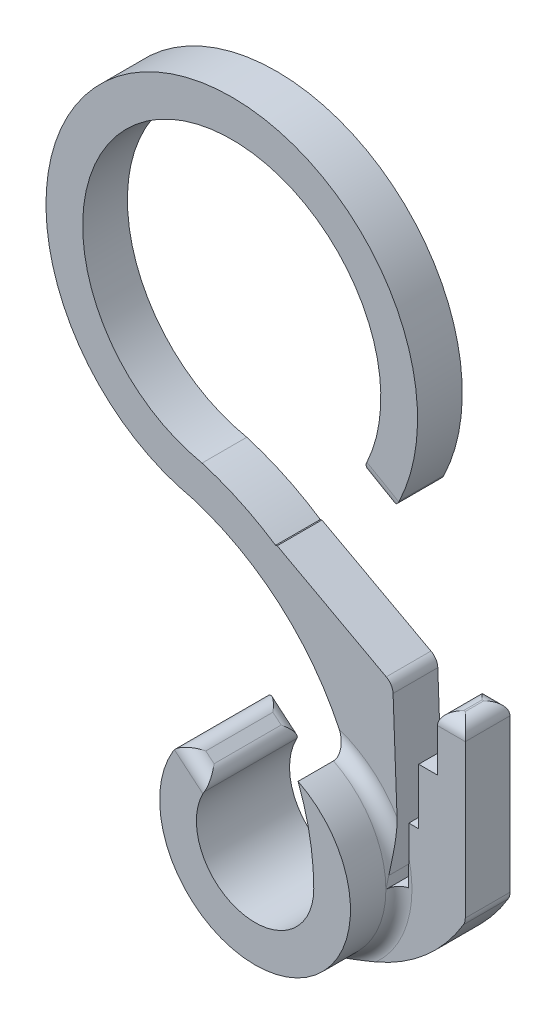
ISO-10303-21;
HEADER;
FILE_DESCRIPTION(('STEP AP214'),'2;1');
FILE_NAME('part.step','',(''),(''),'','','');
FILE_SCHEMA(('AUTOMOTIVE_DESIGN { 1 0 10303 214 1 1 1 1 }'));
ENDSEC;
DATA;
#1=APPLICATION_CONTEXT('core data for automotive mechanical design processes');
#2=APPLICATION_PROTOCOL_DEFINITION('international standard','automotive_design',2000,#1);
#3=PRODUCT_CONTEXT('',#1,'mechanical');
#4=PRODUCT('Part','Part','',(#3));
#5=PRODUCT_RELATED_PRODUCT_CATEGORY('part','',(#4));
#6=PRODUCT_DEFINITION_FORMATION('','',#4);
#7=PRODUCT_DEFINITION_CONTEXT('part definition',#1,'design');
#8=PRODUCT_DEFINITION('design','',#6,#7);
#9=PRODUCT_DEFINITION_SHAPE('','',#8);
#10=(LENGTH_UNIT() NAMED_UNIT(*) SI_UNIT(.MILLI.,.METRE.));
#11=(NAMED_UNIT(*) PLANE_ANGLE_UNIT() SI_UNIT($,.RADIAN.));
#12=(NAMED_UNIT(*) SI_UNIT($,.STERADIAN.) SOLID_ANGLE_UNIT());
#13=UNCERTAINTY_MEASURE_WITH_UNIT(LENGTH_MEASURE(1.E-05),#10,'distance_accuracy_value','');
#14=(GEOMETRIC_REPRESENTATION_CONTEXT(3) GLOBAL_UNCERTAINTY_ASSIGNED_CONTEXT((#13)) GLOBAL_UNIT_ASSIGNED_CONTEXT((#10,
#11,#12)) REPRESENTATION_CONTEXT('',''));
#15=CARTESIAN_POINT('',(0.,0.,0.));
#16=DIRECTION('',(0.,0.,1.));
#17=DIRECTION('',(1.,0.,0.));
#18=AXIS2_PLACEMENT_3D('',#15,#16,#17);
#19=CARTESIAN_POINT('',(0.,0.,3.1));
#20=DIRECTION('',(0.,0.,1.));
#21=DIRECTION('',(1.,0.,0.));
#22=AXIS2_PLACEMENT_3D('',#19,#20,#21);
#23=TOROIDAL_SURFACE('',#22,5.82,0.7);
#24=CARTESIAN_POINT('',(5.82,0.,3.1));
#25=DIRECTION('',(0.,1.,0.));
#26=DIRECTION('',(-1.,0.,0.));
#27=AXIS2_PLACEMENT_3D('',#24,#25,#26);
#28=CIRCLE('',#27,0.7);
#29=CARTESIAN_POINT('',(5.12,0.,3.09999793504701));
#30=VERTEX_POINT('',#29);
#31=CARTESIAN_POINT('',(5.65,0.,2.4209565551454));
#32=VERTEX_POINT('',#31);
#33=EDGE_CURVE('E107',#30,#32,#28,.F.);
#34=ORIENTED_EDGE('',*,*,#33,.F.);
#35=CARTESIAN_POINT('',(0.,0.,3.1));
#36=DIRECTION('',(0.,0.,1.));
#37=DIRECTION('',(1.,0.,0.));
#38=AXIS2_PLACEMENT_3D('',#35,#36,#37);
#39=CIRCLE('',#38,5.12);
#40=CARTESIAN_POINT('',(0.,-5.12,3.1));
#41=VERTEX_POINT('',#40);
#42=EDGE_CURVE('E514',#41,#30,#39,.T.);
#43=ORIENTED_EDGE('',*,*,#42,.F.);
#44=CARTESIAN_POINT('',(3.88248314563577,-4.3357496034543,2.4));
#45=CARTESIAN_POINT('',(3.77393906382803,-4.3814716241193,2.400042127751));
#46=CARTESIAN_POINT('',(3.66462624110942,-4.42524937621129,2.4031480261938));
#47=CARTESIAN_POINT('',(3.44484362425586,-4.508808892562,2.41462716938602));
#48=CARTESIAN_POINT('',(3.33437475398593,-4.54859361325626,2.42299648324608));
#49=CARTESIAN_POINT('',(3.11268098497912,-4.6240656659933,2.4441274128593));
#50=CARTESIAN_POINT('',(3.00145763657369,-4.6597596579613,2.45688175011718));
#51=CARTESIAN_POINT('',(2.77826335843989,-4.72711763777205,2.48614227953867));
#52=CARTESIAN_POINT('',(2.6662922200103,-4.75878044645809,2.50264956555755));
#53=CARTESIAN_POINT('',(2.34495078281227,-4.84364442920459,2.55444875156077));
#54=CARTESIAN_POINT('',(2.13487113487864,-4.89186779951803,2.59366236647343));
#55=CARTESIAN_POINT('',(1.71363145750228,-4.97445557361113,2.67993887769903));
#56=CARTESIAN_POINT('',(1.50247098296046,-5.00881370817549,2.72700531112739));
#57=CARTESIAN_POINT('',(0.868026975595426,-5.09138398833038,2.8758828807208));
#58=CARTESIAN_POINT('',(0.443595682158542,-5.11914035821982,2.98540697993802));
#59=CARTESIAN_POINT('',(0.0132213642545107,-5.1199934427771,3.09658450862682));
#60=CARTESIAN_POINT('',(0.00661059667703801,-5.11999999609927,3.09829228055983));
#61=CARTESIAN_POINT('',(0.,-5.12,3.1));
#62=B_SPLINE_CURVE_WITH_KNOTS('',3,(#44,#45,#46,#47,#48,#49,#50,#51,#52,#53,#54,#55,#56,#57,#58,
#59,#60,#61),.UNSPECIFIED.,.F.,.F.,(4,2,2,2,2,2,2,2,4),(0.,0.353218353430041,0.706173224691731,
1.05854504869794,1.41101970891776,2.06750890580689,2.72429460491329,4.03728688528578,
4.05777025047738),.UNSPECIFIED.);
#63=CARTESIAN_POINT('',(3.88248314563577,-4.3357496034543,2.4));
#64=VERTEX_POINT('',#63);
#65=EDGE_CURVE('E99',#64,#41,#62,.T.);
#66=ORIENTED_EDGE('',*,*,#65,.F.);
#67=CARTESIAN_POINT('',(0.,0.,2.4));
#68=DIRECTION('',(0.,0.,1.));
#69=DIRECTION('',(1.,0.,0.));
#70=AXIS2_PLACEMENT_3D('',#67,#68,#69);
#71=CIRCLE('',#70,5.82);
#72=CARTESIAN_POINT('',(5.65,1.39638819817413,2.4));
#73=VERTEX_POINT('',#72);
#74=EDGE_CURVE('E527',#73,#64,#71,.F.);
#75=ORIENTED_EDGE('',*,*,#74,.F.);
#76=CARTESIAN_POINT('',(5.65,0.,2.4209565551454));
#77=CARTESIAN_POINT('',(5.65,0.0581933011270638,2.42096290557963));
#78=CARTESIAN_POINT('',(5.65,0.116386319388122,2.42073077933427));
#79=CARTESIAN_POINT('',(5.65,0.232767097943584,2.41984357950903));
#80=CARTESIAN_POINT('',(5.65,0.290954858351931,2.41918852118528));
#81=CARTESIAN_POINT('',(5.65,0.465509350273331,2.41666992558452));
#82=CARTESIAN_POINT('',(5.65,0.58186745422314,2.41425296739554));
#83=CARTESIAN_POINT('',(5.65,0.814567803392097,2.40898907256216));
#84=CARTESIAN_POINT('',(5.65,0.930910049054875,2.40614215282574));
#85=CARTESIAN_POINT('',(5.65,1.10544473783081,2.40277443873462));
#86=CARTESIAN_POINT('',(5.65,1.16362709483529,2.40180230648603));
#87=CARTESIAN_POINT('',(5.65,1.28000140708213,2.40041717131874));
#88=CARTESIAN_POINT('',(5.65,1.33819336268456,2.4000042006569));
#89=CARTESIAN_POINT('',(5.65,1.39638819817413,2.4));
#90=B_SPLINE_CURVE_WITH_KNOTS('',3,(#76,#77,#78,#79,#80,#81,#82,#83,#84,#85,#86,#87,#88,#89),
.UNSPECIFIED.,.F.,.F.,(4,2,2,2,2,2,4),(0.,0.174579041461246,0.349151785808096,0.698296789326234,
1.04742806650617,1.22199714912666,1.3965763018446),.UNSPECIFIED.);
#91=EDGE_CURVE('E739',#32,#73,#90,.T.);
#92=ORIENTED_EDGE('',*,*,#91,.F.);
#93=EDGE_LOOP('',(#34,#43,#66,#75,#92));
#94=FACE_BOUND('',#93,.T.);
#95=ADVANCED_FACE('F89',(#94),#23,.F.);
#96=CARTESIAN_POINT('',(-9.68336484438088,0.,2.4));
#97=DIRECTION('',(0.,0.,-1.));
#98=DIRECTION('',(-1.,0.,0.));
#99=AXIS2_PLACEMENT_3D('',#96,#97,#98);
#100=CYLINDRICAL_SURFACE('',#99,14.8033648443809);
#101=DIRECTION('',(0.,0.,-1.));
#102=VECTOR('',#101,1.);
#103=CARTESIAN_POINT('',(5.10941087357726,0.559818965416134,2.4));
#104=LINE('',#103,#102);
#105=CARTESIAN_POINT('',(5.10941087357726,0.559818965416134,2.93391660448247));
#106=VERTEX_POINT('',#105);
#107=CARTESIAN_POINT('',(5.10941087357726,0.559818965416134,0.));
#108=VERTEX_POINT('',#107);
#109=EDGE_CURVE('E114',#106,#108,#104,.T.);
#110=ORIENTED_EDGE('',*,*,#109,.F.);
#111=CARTESIAN_POINT('',(5.10941087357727,0.559818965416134,2.93391660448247));
#112=CARTESIAN_POINT('',(5.11625655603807,0.378776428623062,2.98718383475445));
#113=CARTESIAN_POINT('',(5.1197830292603,0.197820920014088,3.04085509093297));
#114=CARTESIAN_POINT('',(5.11999676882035,0.0113015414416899,3.09661985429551));
#115=CARTESIAN_POINT('',(5.12000000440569,0.00565072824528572,3.09830972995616));
#116=CARTESIAN_POINT('',(5.11999999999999,0.,3.1));
#117=B_SPLINE_CURVE_WITH_KNOTS('',3,(#111,#112,#113,#114,#115,#116),.UNSPECIFIED.,.F.,.F.,(4,2,
4),(0.,0.566340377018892,0.584034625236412),.UNSPECIFIED.);
#118=EDGE_CURVE('E712',#106,#30,#117,.T.);
#119=ORIENTED_EDGE('',*,*,#118,.T.);
#120=DIRECTION('',(0.,0.,-1.));
#121=VECTOR('',#120,1.);
#122=CARTESIAN_POINT('',(5.12,0.,2.4));
#123=LINE('',#122,#121);
#124=CARTESIAN_POINT('',(5.12,0.,0.));
#125=VERTEX_POINT('',#124);
#126=EDGE_CURVE('E465',#30,#125,#123,.T.);
#127=ORIENTED_EDGE('',*,*,#126,.T.);
#128=CARTESIAN_POINT('',(-9.68336484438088,0.,0.));
#129=DIRECTION('',(0.,0.,1.));
#130=DIRECTION('',(1.,0.,0.));
#131=AXIS2_PLACEMENT_3D('',#128,#129,#130);
#132=CIRCLE('',#131,14.8033648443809);
#133=EDGE_CURVE('E466',#125,#108,#132,.T.);
#134=ORIENTED_EDGE('',*,*,#133,.T.);
#135=EDGE_LOOP('',(#110,#119,#127,#134));
#136=FACE_BOUND('',#135,.T.);
#137=ADVANCED_FACE('F774',(#136),#100,.T.);
#138=CARTESIAN_POINT('',(0.,0.,5.));
#139=DIRECTION('',(0.,0.,-1.));
#140=DIRECTION('',(-1.,0.,0.));
#141=AXIS2_PLACEMENT_3D('',#138,#139,#140);
#142=CYLINDRICAL_SURFACE('',#141,5.12);
#143=CARTESIAN_POINT('',(0.,0.,5.));
#144=DIRECTION('',(0.,0.,1.));
#145=DIRECTION('',(1.,0.,0.));
#146=AXIS2_PLACEMENT_3D('',#143,#144,#145);
#147=CIRCLE('',#146,5.12);
#148=CARTESIAN_POINT('',(-4.39385934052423,2.62838355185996,5.));
#149=VERTEX_POINT('',#148);
#150=CARTESIAN_POINT('',(2.3087686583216,4.56990013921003,5.));
#151=VERTEX_POINT('',#150);
#152=EDGE_CURVE('E494',#149,#151,#147,.T.);
#153=ORIENTED_EDGE('',*,*,#152,.F.);
#154=DIRECTION('',(0.,0.,-1.));
#155=VECTOR('',#154,1.);
#156=CARTESIAN_POINT('',(-4.39385934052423,2.62838355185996,5.));
#157=LINE('',#156,#155);
#158=CARTESIAN_POINT('',(-4.39385934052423,2.62838355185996,0.));
#159=VERTEX_POINT('',#158);
#160=EDGE_CURVE('E518',#149,#159,#157,.T.);
#161=ORIENTED_EDGE('',*,*,#160,.T.);
#162=CARTESIAN_POINT('',(0.,0.,0.));
#163=DIRECTION('',(0.,0.,1.));
#164=DIRECTION('',(1.,0.,0.));
#165=AXIS2_PLACEMENT_3D('',#162,#163,#164);
#166=CIRCLE('',#165,5.12);
#167=CARTESIAN_POINT('',(0.,-5.12,0.));
#168=VERTEX_POINT('',#167);
#169=EDGE_CURVE('E491',#159,#168,#166,.T.);
#170=ORIENTED_EDGE('',*,*,#169,.T.);
#171=DIRECTION('',(0.,0.,-1.));
#172=VECTOR('',#171,1.);
#173=CARTESIAN_POINT('',(0.,-5.12,2.4));
#174=LINE('',#173,#172);
#175=EDGE_CURVE('E402',#41,#168,#174,.T.);
#176=ORIENTED_EDGE('',*,*,#175,.F.);
#177=ORIENTED_EDGE('',*,*,#42,.T.);
#178=CARTESIAN_POINT('',(2.3087686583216,4.56990013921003,3.1));
#179=VERTEX_POINT('',#178);
#180=EDGE_CURVE('E515',#30,#179,#39,.T.);
#181=ORIENTED_EDGE('',*,*,#180,.T.);
#182=DIRECTION('',(0.,0.,-1.));
#183=VECTOR('',#182,1.);
#184=CARTESIAN_POINT('',(2.3087686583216,4.56990013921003,5.));
#185=LINE('',#184,#183);
#186=EDGE_CURVE('E497',#151,#179,#185,.T.);
#187=ORIENTED_EDGE('',*,*,#186,.F.);
#188=EDGE_LOOP('',(#153,#161,#170,#176,#177,#181,#187));
#189=FACE_BOUND('',#188,.T.);
#190=ADVANCED_FACE('F779',(#189),#142,.T.);
#191=CARTESIAN_POINT('',(-9.68336484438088,0.,5.));
#192=DIRECTION('',(0.,0.,-1.));
#193=DIRECTION('',(-1.,0.,0.));
#194=AXIS2_PLACEMENT_3D('',#191,#192,#193);
#195=CYLINDRICAL_SURFACE('',#194,12.8333648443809);
#196=CARTESIAN_POINT('',(-9.68336484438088,0.,0.));
#197=DIRECTION('',(0.,0.,1.));
#198=DIRECTION('',(1.,0.,0.));
#199=AXIS2_PLACEMENT_3D('',#196,#197,#198);
#200=CIRCLE('',#199,12.8333648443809);
#201=CARTESIAN_POINT('',(3.15,0.,0.));
#202=VERTEX_POINT('',#201);
#203=CARTESIAN_POINT('',(-5.93298482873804,12.273137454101,0.));
#204=VERTEX_POINT('',#203);
#205=EDGE_CURVE('E485',#202,#204,#200,.T.);
#206=ORIENTED_EDGE('',*,*,#205,.F.);
#207=DIRECTION('',(0.,0.,-1.));
#208=VECTOR('',#207,1.);
#209=CARTESIAN_POINT('',(3.15,0.,5.));
#210=LINE('',#209,#208);
#211=CARTESIAN_POINT('',(3.15,0.,5.));
#212=VERTEX_POINT('',#211);
#213=EDGE_CURVE('E510',#212,#202,#210,.T.);
#214=ORIENTED_EDGE('',*,*,#213,.F.);
#215=CARTESIAN_POINT('',(-9.68336484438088,0.,5.));
#216=DIRECTION('',(0.,0.,1.));
#217=DIRECTION('',(1.,0.,0.));
#218=AXIS2_PLACEMENT_3D('',#215,#216,#217);
#219=CIRCLE('',#218,12.8333648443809);
#220=EDGE_CURVE('E486',#212,#151,#219,.T.);
#221=ORIENTED_EDGE('',*,*,#220,.T.);
#222=ORIENTED_EDGE('',*,*,#186,.T.);
#223=CARTESIAN_POINT('',(2.3087686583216,4.56990013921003,3.1));
#224=CARTESIAN_POINT('',(2.30876978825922,4.56989655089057,3.08462641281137));
#225=CARTESIAN_POINT('',(2.30850064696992,4.57060349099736,3.06926297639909));
#226=CARTESIAN_POINT('',(2.30743494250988,4.57339886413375,3.03869538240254));
#227=CARTESIAN_POINT('',(2.30663889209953,4.57548595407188,3.02349108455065));
#228=CARTESIAN_POINT('',(2.30350172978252,4.58370137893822,2.97860215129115));
#229=CARTESIAN_POINT('',(2.3004109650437,4.5917857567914,2.94930796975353));
#230=CARTESIAN_POINT('',(2.29247181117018,4.61245149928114,2.89278139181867));
#231=CARTESIAN_POINT('',(2.28762964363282,4.62501694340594,2.86554210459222));
#232=CARTESIAN_POINT('',(2.27645784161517,4.65383009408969,2.81335747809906));
#233=CARTESIAN_POINT('',(2.27012423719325,4.6700876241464,2.78841851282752));
#234=CARTESIAN_POINT('',(2.25298766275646,4.71375786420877,2.7299894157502));
#235=CARTESIAN_POINT('',(2.24147940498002,4.74283273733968,2.69795108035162));
#236=CARTESIAN_POINT('',(2.2164820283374,4.80520925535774,2.63923145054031));
#237=CARTESIAN_POINT('',(2.20298899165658,4.83851924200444,2.61256100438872));
#238=CARTESIAN_POINT('',(2.16856574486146,4.92237706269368,2.5542858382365));
#239=CARTESIAN_POINT('',(2.14686730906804,4.9743573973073,2.52520085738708));
#240=CARTESIAN_POINT('',(2.10120811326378,5.08158575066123,2.47628917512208));
#241=CARTESIAN_POINT('',(2.07724328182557,5.13683958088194,2.45647953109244));
#242=CARTESIAN_POINT('',(2.03030126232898,5.24292479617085,2.42729658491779));
#243=CARTESIAN_POINT('',(2.00749614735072,5.29359073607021,2.41702837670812));
#244=CARTESIAN_POINT('',(1.96101889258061,5.39506520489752,2.40341895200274));
#245=CARTESIAN_POINT('',(1.93735311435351,5.44587082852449,2.40003453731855));
#246=CARTESIAN_POINT('',(1.91334825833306,5.49649874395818,2.4));
#247=B_SPLINE_CURVE_WITH_KNOTS('',3,(#223,#224,#225,#226,#227,#228,#229,#230,#231,#232,#233,
#234,#235,#236,#237,#238,#239,#240,#241,#242,#243,#244,#245,#246),.UNSPECIFIED.,.F.,.F.,(4,2,2,
2,2,2,2,2,2,2,2,4),(0.,0.0460831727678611,0.0921215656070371,0.183214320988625,
0.273986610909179,0.365003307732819,0.498563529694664,0.6323910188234,0.821555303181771,
1.01106610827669,1.18014540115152,1.34816034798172),.UNSPECIFIED.);
#248=CARTESIAN_POINT('',(1.91334825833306,5.49649874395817,2.4));
#249=VERTEX_POINT('',#248);
#250=EDGE_CURVE('E12',#179,#249,#247,.T.);
#251=ORIENTED_EDGE('',*,*,#250,.T.);
#252=CARTESIAN_POINT('',(-9.68336484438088,0.,2.4));
#253=DIRECTION('',(0.,0.,1.));
#254=DIRECTION('',(1.,0.,0.));
#255=AXIS2_PLACEMENT_3D('',#252,#253,#254);
#256=CIRCLE('',#255,12.8333648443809);
#257=CARTESIAN_POINT('',(-5.93298482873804,12.273137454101,2.4));
#258=VERTEX_POINT('',#257);
#259=EDGE_CURVE('E462',#249,#258,#256,.T.);
#260=ORIENTED_EDGE('',*,*,#259,.T.);
#261=DIRECTION('',(0.,0.,-1.));
#262=VECTOR('',#261,1.);
#263=CARTESIAN_POINT('',(-5.93298482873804,12.273137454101,2.4));
#264=LINE('',#263,#262);
#265=EDGE_CURVE('E477',#258,#204,#264,.T.);
#266=ORIENTED_EDGE('',*,*,#265,.T.);
#267=EDGE_LOOP('',(#206,#214,#221,#222,#251,#260,#266));
#268=FACE_BOUND('',#267,.T.);
#269=ADVANCED_FACE('F726',(#268),#195,.F.);
#270=CARTESIAN_POINT('',(0.,0.,5.));
#271=DIRECTION('',(0.,0.,-1.));
#272=DIRECTION('',(-1.,0.,0.));
#273=AXIS2_PLACEMENT_3D('',#270,#271,#272);
#274=CYLINDRICAL_SURFACE('',#273,3.15);
#275=DIRECTION('',(0.,0.,-1.));
#276=VECTOR('',#275,1.);
#277=CARTESIAN_POINT('',(-2.74096184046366,1.55229771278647,5.));
#278=LINE('',#277,#276);
#279=CARTESIAN_POINT('',(-2.74096184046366,1.55229771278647,0.0116674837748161));
#280=VERTEX_POINT('',#279);
#281=CARTESIAN_POINT('',(-2.74096184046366,1.55229771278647,4.98833251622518));
#282=VERTEX_POINT('',#281);
#283=EDGE_CURVE('E662',#280,#282,#278,.F.);
#284=ORIENTED_EDGE('',*,*,#283,.T.);
#285=CARTESIAN_POINT('',(-2.74096184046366,1.55229771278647,4.98833251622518));
#286=CARTESIAN_POINT('',(-2.75155432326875,1.53360130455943,4.99222646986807));
#287=CARTESIAN_POINT('',(-2.76199172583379,1.51472181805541,4.99514573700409));
#288=CARTESIAN_POINT('',(-2.78255637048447,1.47659668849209,4.9990348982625));
#289=CARTESIAN_POINT('',(-2.79268361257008,1.45735104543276,5.00000479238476));
#290=CARTESIAN_POINT('',(-2.80265577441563,1.43792232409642,5.00000000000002));
#291=B_SPLINE_CURVE_WITH_KNOTS('',3,(#285,#286,#287,#288,#289,#290),.UNSPECIFIED.,.F.,.F.,(4,2,
4),(0.,0.0653074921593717,0.13061498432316),.UNSPECIFIED.);
#292=CARTESIAN_POINT('',(-2.80265577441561,1.43792232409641,5.));
#293=VERTEX_POINT('',#292);
#294=EDGE_CURVE('E682',#282,#293,#291,.T.);
#295=ORIENTED_EDGE('',*,*,#294,.T.);
#296=CARTESIAN_POINT('',(0.,0.,5.));
#297=DIRECTION('',(0.,0.,1.));
#298=DIRECTION('',(1.,0.,0.));
#299=AXIS2_PLACEMENT_3D('',#296,#297,#298);
#300=CIRCLE('',#299,3.15);
#301=EDGE_CURVE('E490',#293,#212,#300,.T.);
#302=ORIENTED_EDGE('',*,*,#301,.T.);
#303=ORIENTED_EDGE('',*,*,#213,.T.);
#304=CARTESIAN_POINT('',(0.,0.,0.));
#305=DIRECTION('',(0.,0.,1.));
#306=DIRECTION('',(1.,0.,0.));
#307=AXIS2_PLACEMENT_3D('',#304,#305,#306);
#308=CIRCLE('',#307,3.15);
#309=CARTESIAN_POINT('',(-2.80265577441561,1.43792232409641,0.));
#310=VERTEX_POINT('',#309);
#311=EDGE_CURVE('E501',#310,#202,#308,.T.);
#312=ORIENTED_EDGE('',*,*,#311,.F.);
#313=CARTESIAN_POINT('',(-2.80265577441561,1.43792232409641,0.));
#314=CARTESIAN_POINT('',(-2.79268361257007,1.45735104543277,-4.79238479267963E-06));
#315=CARTESIAN_POINT('',(-2.78255637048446,1.4765966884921,0.000965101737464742));
#316=CARTESIAN_POINT('',(-2.76199172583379,1.51472181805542,0.00485426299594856));
#317=CARTESIAN_POINT('',(-2.75155432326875,1.53360130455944,0.00777353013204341));
#318=CARTESIAN_POINT('',(-2.74096184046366,1.55229771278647,0.0116674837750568));
#319=B_SPLINE_CURVE_WITH_KNOTS('',3,(#313,#314,#315,#316,#317,#318),.UNSPECIFIED.,.F.,.F.,(4,2,
4),(0.,0.0653074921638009,0.130614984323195),.UNSPECIFIED.);
#320=EDGE_CURVE('E653',#310,#280,#319,.T.);
#321=ORIENTED_EDGE('',*,*,#320,.T.);
#322=EDGE_LOOP('',(#284,#295,#302,#303,#312,#321));
#323=FACE_BOUND('',#322,.T.);
#324=ADVANCED_FACE('F664',(#323),#274,.F.);
#325=CARTESIAN_POINT('',(0.,0.,5.));
#326=DIRECTION('',(-0.642787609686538,-0.766044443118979,0.));
#327=DIRECTION('',(0.766044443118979,-0.642787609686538,0.));
#328=AXIS2_PLACEMENT_3D('',#325,#326,#327);
#329=PLANE('',#328);
#330=DIRECTION('',(-0.766044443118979,0.642787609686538,0.));
#331=VECTOR('',#330,1.);
#332=CARTESIAN_POINT('',(-2.41303999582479,2.02478097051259,4.3));
#333=LINE('',#332,#331);
#334=CARTESIAN_POINT('',(-3.34318505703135,2.80526534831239,4.3));
#335=VERTEX_POINT('',#334);
#336=CARTESIAN_POINT('',(-2.90011314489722,2.43348387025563,4.3));
#337=VERTEX_POINT('',#336);
#338=EDGE_CURVE('E646',#335,#337,#333,.F.);
#339=ORIENTED_EDGE('',*,*,#338,.T.);
#340=DIRECTION('',(0.,0.,1.));
#341=VECTOR('',#340,1.);
#342=CARTESIAN_POINT('',(-2.90011314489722,2.43348387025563,0.));
#343=LINE('',#342,#341);
#344=CARTESIAN_POINT('',(-2.90011314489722,2.43348387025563,0.7));
#345=VERTEX_POINT('',#344);
#346=EDGE_CURVE('E649',#337,#345,#343,.F.);
#347=ORIENTED_EDGE('',*,*,#346,.T.);
#348=DIRECTION('',(-0.766044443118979,0.642787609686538,0.));
#349=VECTOR('',#348,1.);
#350=CARTESIAN_POINT('',(0.,0.,0.7));
#351=LINE('',#350,#349);
#352=CARTESIAN_POINT('',(-3.34318505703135,2.80526534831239,0.7));
#353=VERTEX_POINT('',#352);
#354=EDGE_CURVE('E640',#345,#353,#351,.T.);
#355=ORIENTED_EDGE('',*,*,#354,.T.);
#356=DIRECTION('',(0.,0.,-1.));
#357=VECTOR('',#356,1.);
#358=CARTESIAN_POINT('',(-3.34318505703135,2.80526534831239,5.));
#359=LINE('',#358,#357);
#360=EDGE_CURVE('E643',#353,#335,#359,.F.);
#361=ORIENTED_EDGE('',*,*,#360,.T.);
#362=EDGE_LOOP('',(#339,#347,#355,#361));
#363=FACE_BOUND('',#362,.T.);
#364=ADVANCED_FACE('F877',(#363),#329,.F.);
#365=CARTESIAN_POINT('',(0.,0.,5.));
#366=DIRECTION('',(0.,0.,1.));
#367=DIRECTION('',(1.,0.,0.));
#368=AXIS2_PLACEMENT_3D('',#365,#366,#367);
#369=PLANE('',#368);
#370=ORIENTED_EDGE('',*,*,#301,.F.);
#371=DIRECTION('',(-0.766044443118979,0.642787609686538,0.));
#372=VECTOR('',#371,1.);
#373=CARTESIAN_POINT('',(-4.37209887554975,2.75484145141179,5.));
#374=LINE('',#373,#372);
#375=CARTESIAN_POINT('',(-4.32936749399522,2.71898556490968,5.));
#376=VERTEX_POINT('',#375);
#377=EDGE_CURVE('E692',#293,#376,#374,.T.);
#378=ORIENTED_EDGE('',*,*,#377,.T.);
#379=CARTESIAN_POINT('',(-3.79313638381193,2.26903423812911,5.));
#380=DIRECTION('',(0.,0.,1.));
#381=DIRECTION('',(1.,0.,0.));
#382=AXIS2_PLACEMENT_3D('',#379,#380,#381);
#383=CIRCLE('',#382,0.7);
#384=EDGE_CURVE('E689',#376,#149,#383,.T.);
#385=ORIENTED_EDGE('',*,*,#384,.T.);
#386=ORIENTED_EDGE('',*,*,#152,.T.);
#387=ORIENTED_EDGE('',*,*,#220,.F.);
#388=EDGE_LOOP('',(#370,#378,#385,#386,#387));
#389=FACE_BOUND('',#388,.T.);
#390=ADVANCED_FACE('F794',(#389),#369,.T.);
#391=CARTESIAN_POINT('',(0.,0.,0.));
#392=DIRECTION('',(0.,0.,1.));
#393=DIRECTION('',(1.,0.,0.));
#394=AXIS2_PLACEMENT_3D('',#391,#392,#393);
#395=PLANE('',#394);
#396=CARTESIAN_POINT('',(-3.85104953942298,22.0233397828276,0.));
#397=DIRECTION('',(0.,0.,1.));
#398=DIRECTION('',(1.,0.,0.));
#399=AXIS2_PLACEMENT_3D('',#396,#397,#398);
#400=CIRCLE('',#399,9.97);
#401=CARTESIAN_POINT('',(5.13500103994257,17.7045673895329,0.));
#402=VERTEX_POINT('',#401);
#403=EDGE_CURVE('E455',#402,#204,#400,.T.);
#404=ORIENTED_EDGE('',*,*,#403,.F.);
#405=CARTESIAN_POINT('',(4.50408475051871,18.0077911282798,0.));
#406=DIRECTION('',(0.,0.,1.));
#407=DIRECTION('',(1.,0.,0.));
#408=AXIS2_PLACEMENT_3D('',#405,#406,#407);
#409=CIRCLE('',#408,0.7);
#410=CARTESIAN_POINT('',(5.11030253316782,17.6577911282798,0.));
#411=VERTEX_POINT('',#410);
#412=EDGE_CURVE('E613',#402,#411,#409,.F.);
#413=ORIENTED_EDGE('',*,*,#412,.T.);
#414=DIRECTION('',(0.86602540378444,-0.499999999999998,0.));
#415=VECTOR('',#414,1.);
#416=CARTESIAN_POINT('',(8.92362347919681,15.4561692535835,0.));
#417=LINE('',#416,#415);
#418=CARTESIAN_POINT('',(3.40058070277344,18.6448994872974,0.));
#419=VERTEX_POINT('',#418);
#420=EDGE_CURVE('E610',#411,#419,#417,.F.);
#421=ORIENTED_EDGE('',*,*,#420,.T.);
#422=CARTESIAN_POINT('',(-3.85104953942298,22.0233397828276,0.));
#423=DIRECTION('',(0.,0.,1.));
#424=DIRECTION('',(1.,0.,0.));
#425=AXIS2_PLACEMENT_3D('',#422,#423,#424);
#426=CIRCLE('',#425,8.);
#427=CARTESIAN_POINT('',(-5.44596493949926,14.1839364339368,0.));
#428=VERTEX_POINT('',#427);
#429=EDGE_CURVE('E469',#419,#428,#426,.T.);
#430=ORIENTED_EDGE('',*,*,#429,.T.);
#431=CARTESIAN_POINT('',(-1.49856554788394,12.3348559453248,0.));
#432=VERTEX_POINT('',#431);
#433=EDGE_CURVE('E450',#432,#428,#132,.T.);
#434=ORIENTED_EDGE('',*,*,#433,.F.);
#435=CARTESIAN_POINT('',(-3.85104953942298,22.0233397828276,0.));
#436=DIRECTION('',(0.,0.,1.));
#437=DIRECTION('',(1.,0.,0.));
#438=AXIS2_PLACEMENT_3D('',#435,#436,#437);
#439=CIRCLE('',#438,9.97);
#440=CARTESIAN_POINT('',(-1.41246249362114,12.3561688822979,0.));
#441=VERTEX_POINT('',#440);
#442=EDGE_CURVE('E362',#432,#441,#439,.T.);
#443=ORIENTED_EDGE('',*,*,#442,.T.);
#444=DIRECTION('',(-0.879499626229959,0.475899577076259,0.));
#445=VECTOR('',#444,1.);
#446=CARTESIAN_POINT('',(4.85182265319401,8.96654759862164,0.));
#447=LINE('',#446,#445);
#448=CARTESIAN_POINT('',(4.43873426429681,9.1900708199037,0.));
#449=VERTEX_POINT('',#448);
#450=EDGE_CURVE('E345',#449,#441,#447,.T.);
#451=ORIENTED_EDGE('',*,*,#450,.F.);
#452=CARTESIAN_POINT('',(4.10560456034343,8.57442108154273,0.));
#453=DIRECTION('',(0.,0.,1.));
#454=DIRECTION('',(1.,0.,0.));
#455=AXIS2_PLACEMENT_3D('',#452,#453,#454);
#456=CIRCLE('',#455,0.7);
#457=CARTESIAN_POINT('',(4.8051038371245,8.6008929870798,0.));
#458=VERTEX_POINT('',#457);
#459=EDGE_CURVE('E595',#449,#458,#456,.F.);
#460=ORIENTED_EDGE('',*,*,#459,.T.);
#461=DIRECTION('',(-0.037817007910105,0.99928468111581,0.));
#462=VECTOR('',#461,1.);
#463=CARTESIAN_POINT('',(5.12325930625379,0.193885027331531,0.));
#464=LINE('',#463,#462);
#465=EDGE_CURVE('E359',#108,#458,#464,.T.);
#466=ORIENTED_EDGE('',*,*,#465,.F.);
#467=ORIENTED_EDGE('',*,*,#133,.F.);
#468=DIRECTION('',(1.,0.,0.));
#469=VECTOR('',#468,1.);
#470=CARTESIAN_POINT('',(0.,0.,0.));
#471=LINE('',#470,#469);
#472=CARTESIAN_POINT('',(5.65,0.,0.));
#473=VERTEX_POINT('',#472);
#474=EDGE_CURVE('E379',#125,#473,#471,.T.);
#475=ORIENTED_EDGE('',*,*,#474,.T.);
#476=DIRECTION('',(0.,1.,0.));
#477=VECTOR('',#476,1.);
#478=CARTESIAN_POINT('',(5.65,0.,0.));
#479=LINE('',#478,#477);
#480=CARTESIAN_POINT('',(5.65,3.,0.));
#481=VERTEX_POINT('',#480);
#482=EDGE_CURVE('E425',#473,#481,#479,.T.);
#483=ORIENTED_EDGE('',*,*,#482,.T.);
#484=DIRECTION('',(1.,0.,0.));
#485=VECTOR('',#484,1.);
#486=CARTESIAN_POINT('',(0.,3.,0.));
#487=LINE('',#486,#485);
#488=CARTESIAN_POINT('',(6.18,3.,0.));
#489=VERTEX_POINT('',#488);
#490=EDGE_CURVE('E421',#481,#489,#487,.T.);
#491=ORIENTED_EDGE('',*,*,#490,.T.);
#492=DIRECTION('',(0.,1.,0.));
#493=VECTOR('',#492,1.);
#494=CARTESIAN_POINT('',(6.18,0.,0.));
#495=LINE('',#494,#493);
#496=CARTESIAN_POINT('',(6.18,6.,0.));
#497=VERTEX_POINT('',#496);
#498=EDGE_CURVE('E417',#489,#497,#495,.T.);
#499=ORIENTED_EDGE('',*,*,#498,.T.);
#500=DIRECTION('',(1.,0.,0.));
#501=VECTOR('',#500,1.);
#502=CARTESIAN_POINT('',(0.,6.,0.));
#503=LINE('',#502,#501);
#504=CARTESIAN_POINT('',(7.19,6.,0.));
#505=VERTEX_POINT('',#504);
#506=EDGE_CURVE('E413',#497,#505,#503,.T.);
#507=ORIENTED_EDGE('',*,*,#506,.T.);
#508=DIRECTION('',(0.,1.,0.));
#509=VECTOR('',#508,1.);
#510=CARTESIAN_POINT('',(7.19,0.,0.));
#511=LINE('',#510,#509);
#512=CARTESIAN_POINT('',(7.19,8.3,0.));
#513=VERTEX_POINT('',#512);
#514=EDGE_CURVE('E409',#505,#513,#511,.T.);
#515=ORIENTED_EDGE('',*,*,#514,.T.);
#516=DIRECTION('',(1.,0.,0.));
#517=VECTOR('',#516,1.);
#518=CARTESIAN_POINT('',(8.68,8.3,0.));
#519=LINE('',#518,#517);
#520=CARTESIAN_POINT('',(8.68,8.3,0.));
#521=VERTEX_POINT('',#520);
#522=EDGE_CURVE('E607',#513,#521,#519,.T.);
#523=ORIENTED_EDGE('',*,*,#522,.T.);
#524=DIRECTION('',(0.,-1.,0.));
#525=VECTOR('',#524,1.);
#526=CARTESIAN_POINT('',(8.68,0.,0.));
#527=LINE('',#526,#525);
#528=CARTESIAN_POINT('',(8.68,0.101817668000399,0.));
#529=VERTEX_POINT('',#528);
#530=EDGE_CURVE('E405',#521,#529,#527,.T.);
#531=ORIENTED_EDGE('',*,*,#530,.T.);
#532=CARTESIAN_POINT('',(7.98,0.101817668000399,0.));
#533=DIRECTION('',(0.,0.,1.));
#534=DIRECTION('',(1.,0.,0.));
#535=AXIS2_PLACEMENT_3D('',#532,#533,#534);
#536=CIRCLE('',#535,0.7);
#537=CARTESIAN_POINT('',(8.58049218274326,-0.257917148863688,0.));
#538=VERTEX_POINT('',#537);
#539=EDGE_CURVE('E598',#529,#538,#536,.F.);
#540=ORIENTED_EDGE('',*,*,#539,.T.);
#541=CARTESIAN_POINT('',(0.,4.88236922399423,0.));
#542=DIRECTION('',(0.,0.,1.));
#543=DIRECTION('',(1.,0.,0.));
#544=AXIS2_PLACEMENT_3D('',#541,#542,#543);
#545=CIRCLE('',#544,10.0023692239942);
#546=EDGE_CURVE('E373',#538,#168,#545,.F.);
#547=ORIENTED_EDGE('',*,*,#546,.T.);
#548=ORIENTED_EDGE('',*,*,#169,.F.);
#549=CARTESIAN_POINT('',(-3.79313638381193,2.26903423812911,0.));
#550=DIRECTION('',(0.,0.,1.));
#551=DIRECTION('',(1.,0.,0.));
#552=AXIS2_PLACEMENT_3D('',#549,#550,#551);
#553=CIRCLE('',#552,0.7);
#554=CARTESIAN_POINT('',(-4.32936749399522,2.71898556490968,0.));
#555=VERTEX_POINT('',#554);
#556=EDGE_CURVE('E604',#159,#555,#553,.F.);
#557=ORIENTED_EDGE('',*,*,#556,.T.);
#558=DIRECTION('',(-0.766044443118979,0.642787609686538,0.));
#559=VECTOR('',#558,1.);
#560=CARTESIAN_POINT('',(-0.449951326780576,-0.536231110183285,0.));
#561=LINE('',#560,#559);
#562=EDGE_CURVE('E601',#555,#310,#561,.F.);
#563=ORIENTED_EDGE('',*,*,#562,.T.);
#564=ORIENTED_EDGE('',*,*,#311,.T.);
#565=ORIENTED_EDGE('',*,*,#205,.T.);
#566=EDGE_LOOP('',(#404,#413,#421,#430,#434,#443,#451,#460,#466,#467,#475,#483,#491,#499,#507,
#515,#523,#531,#540,#547,#548,#557,#563,#564,#565));
#567=FACE_BOUND('',#566,.T.);
#568=ADVANCED_FACE('F788',(#567),#395,.F.);
#569=CARTESIAN_POINT('',(-9.68336484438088,0.,2.4));
#570=DIRECTION('',(0.,0.,1.));
#571=DIRECTION('',(1.,0.,0.));
#572=AXIS2_PLACEMENT_3D('',#569,#570,#571);
#573=CIRCLE('',#572,14.8033648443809);
#574=CARTESIAN_POINT('',(-1.49856554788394,12.3348559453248,2.4));
#575=VERTEX_POINT('',#574);
#576=CARTESIAN_POINT('',(-5.44596493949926,14.1839364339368,2.4));
#577=VERTEX_POINT('',#576);
#578=EDGE_CURVE('E451',#575,#577,#573,.T.);
#579=ORIENTED_EDGE('',*,*,#578,.F.);
#580=DIRECTION('',(0.,0.,-1.));
#581=VECTOR('',#580,1.);
#582=CARTESIAN_POINT('',(-1.49856554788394,12.3348559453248,2.4));
#583=LINE('',#582,#581);
#584=EDGE_CURVE('E352',#575,#432,#583,.T.);
#585=ORIENTED_EDGE('',*,*,#584,.T.);
#586=ORIENTED_EDGE('',*,*,#433,.T.);
#587=DIRECTION('',(0.,0.,-1.));
#588=VECTOR('',#587,1.);
#589=CARTESIAN_POINT('',(-5.44596493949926,14.1839364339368,2.4));
#590=LINE('',#589,#588);
#591=EDGE_CURVE('E481',#577,#428,#590,.T.);
#592=ORIENTED_EDGE('',*,*,#591,.F.);
#593=EDGE_LOOP('',(#579,#585,#586,#592));
#594=FACE_BOUND('',#593,.T.);
#595=ADVANCED_FACE('F771',(#594),#100,.T.);
#596=CARTESIAN_POINT('',(-3.85104953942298,22.0233397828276,2.4));
#597=DIRECTION('',(0.,0.,-1.));
#598=DIRECTION('',(-1.,0.,0.));
#599=AXIS2_PLACEMENT_3D('',#596,#597,#598);
#600=CYLINDRICAL_SURFACE('',#599,8.);
#601=DIRECTION('',(0.,0.,-1.));
#602=VECTOR('',#601,1.);
#603=CARTESIAN_POINT('',(3.37653054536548,18.5937499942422,2.4));
#604=LINE('',#603,#602);
#605=CARTESIAN_POINT('',(3.37653054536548,18.5937499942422,0.00226950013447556));
#606=VERTEX_POINT('',#605);
#607=CARTESIAN_POINT('',(3.37653054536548,18.5937499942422,2.39773049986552));
#608=VERTEX_POINT('',#607);
#609=EDGE_CURVE('E552',#606,#608,#604,.F.);
#610=ORIENTED_EDGE('',*,*,#609,.T.);
#611=CARTESIAN_POINT('',(3.37653054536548,18.5937499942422,2.39773049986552));
#612=CARTESIAN_POINT('',(3.38056255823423,18.6022470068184,2.39848696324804));
#613=CARTESIAN_POINT('',(3.38458274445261,18.6107579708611,2.3990543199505));
#614=CARTESIAN_POINT('',(3.39259946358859,18.6278078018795,2.39981081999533));
#615=CARTESIAN_POINT('',(3.39659599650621,18.6363466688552,2.39999996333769));
#616=CARTESIAN_POINT('',(3.40058070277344,18.6448994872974,2.4));
#617=B_SPLINE_CURVE_WITH_KNOTS('',3,(#611,#612,#613,#614,#615,#616),.UNSPECIFIED.,.F.,.F.,(4,2,
4),(0.,0.0282892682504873,0.0565785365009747),.UNSPECIFIED.);
#618=CARTESIAN_POINT('',(3.40058070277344,18.6448994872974,2.4));
#619=VERTEX_POINT('',#618);
#620=EDGE_CURVE('E573',#608,#619,#617,.T.);
#621=ORIENTED_EDGE('',*,*,#620,.T.);
#622=CARTESIAN_POINT('',(-3.85104953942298,22.0233397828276,2.4));
#623=DIRECTION('',(0.,0.,1.));
#624=DIRECTION('',(1.,0.,0.));
#625=AXIS2_PLACEMENT_3D('',#622,#623,#624);
#626=CIRCLE('',#625,8.);
#627=EDGE_CURVE('E454',#619,#577,#626,.T.);
#628=ORIENTED_EDGE('',*,*,#627,.T.);
#629=ORIENTED_EDGE('',*,*,#591,.T.);
#630=ORIENTED_EDGE('',*,*,#429,.F.);
#631=CARTESIAN_POINT('',(3.40058070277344,18.6448994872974,0.));
#632=CARTESIAN_POINT('',(3.39659599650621,18.6363466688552,3.66623112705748E-08));
#633=CARTESIAN_POINT('',(3.3925994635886,18.6278078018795,0.000189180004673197));
#634=CARTESIAN_POINT('',(3.38458274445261,18.6107579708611,0.000945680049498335));
#635=CARTESIAN_POINT('',(3.38056255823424,18.6022470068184,0.00151303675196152));
#636=CARTESIAN_POINT('',(3.37653054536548,18.5937499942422,0.00226950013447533));
#637=B_SPLINE_CURVE_WITH_KNOTS('',3,(#631,#632,#633,#634,#635,#636),.UNSPECIFIED.,.F.,.F.,(4,2,
4),(0.,0.02828926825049,0.0565785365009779),.UNSPECIFIED.);
#638=EDGE_CURVE('E543',#419,#606,#637,.T.);
#639=ORIENTED_EDGE('',*,*,#638,.T.);
#640=EDGE_LOOP('',(#610,#621,#628,#629,#630,#639));
#641=FACE_BOUND('',#640,.T.);
#642=ADVANCED_FACE('F554',(#641),#600,.F.);
#643=CARTESIAN_POINT('',(8.57362347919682,14.8499514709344,2.4));
#644=DIRECTION('',(0.499999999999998,0.86602540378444,0.));
#645=DIRECTION('',(-0.86602540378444,0.499999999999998,0.));
#646=AXIS2_PLACEMENT_3D('',#643,#644,#645);
#647=PLANE('',#646);
#648=DIRECTION('',(0.86602540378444,-0.499999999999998,0.));
#649=VECTOR('',#648,1.);
#650=CARTESIAN_POINT('',(3.07715369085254,18.0233397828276,1.7));
#651=LINE('',#650,#649);
#652=CARTESIAN_POINT('',(4.15408475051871,17.4015733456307,1.7));
#653=VERTEX_POINT('',#652);
#654=CARTESIAN_POINT('',(3.65894380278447,17.6874431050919,1.7));
#655=VERTEX_POINT('',#654);
#656=EDGE_CURVE('E536',#653,#655,#651,.F.);
#657=ORIENTED_EDGE('',*,*,#656,.T.);
#658=DIRECTION('',(0.,0.,1.));
#659=VECTOR('',#658,1.);
#660=CARTESIAN_POINT('',(3.65894380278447,17.6874431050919,0.));
#661=LINE('',#660,#659);
#662=CARTESIAN_POINT('',(3.65894380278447,17.6874431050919,0.7));
#663=VERTEX_POINT('',#662);
#664=EDGE_CURVE('E539',#655,#663,#661,.F.);
#665=ORIENTED_EDGE('',*,*,#664,.T.);
#666=DIRECTION('',(0.86602540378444,-0.499999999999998,0.));
#667=VECTOR('',#666,1.);
#668=CARTESIAN_POINT('',(8.57362347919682,14.8499514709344,0.7));
#669=LINE('',#668,#667);
#670=CARTESIAN_POINT('',(4.15408475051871,17.4015733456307,0.7));
#671=VERTEX_POINT('',#670);
#672=EDGE_CURVE('E530',#663,#671,#669,.T.);
#673=ORIENTED_EDGE('',*,*,#672,.T.);
#674=DIRECTION('',(0.,0.,-1.));
#675=VECTOR('',#674,1.);
#676=CARTESIAN_POINT('',(4.15408475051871,17.4015733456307,2.4));
#677=LINE('',#676,#675);
#678=EDGE_CURVE('E533',#671,#653,#677,.F.);
#679=ORIENTED_EDGE('',*,*,#678,.T.);
#680=EDGE_LOOP('',(#657,#665,#673,#679));
#681=FACE_BOUND('',#680,.T.);
#682=ADVANCED_FACE('F764',(#681),#647,.F.);
#683=CARTESIAN_POINT('',(-3.85104953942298,22.0233397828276,2.4));
#684=DIRECTION('',(0.,0.,-1.));
#685=DIRECTION('',(-1.,0.,0.));
#686=AXIS2_PLACEMENT_3D('',#683,#684,#685);
#687=CYLINDRICAL_SURFACE('',#686,9.97);
#688=CARTESIAN_POINT('',(-3.85104953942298,22.0233397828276,2.4));
#689=DIRECTION('',(0.,0.,1.));
#690=DIRECTION('',(1.,0.,0.));
#691=AXIS2_PLACEMENT_3D('',#688,#689,#690);
#692=CIRCLE('',#691,9.97);
#693=CARTESIAN_POINT('',(5.13500103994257,17.7045673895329,2.4));
#694=VERTEX_POINT('',#693);
#695=EDGE_CURVE('E458',#694,#258,#692,.T.);
#696=ORIENTED_EDGE('',*,*,#695,.F.);
#697=DIRECTION('',(0.,0.,-1.));
#698=VECTOR('',#697,1.);
#699=CARTESIAN_POINT('',(5.13500103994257,17.7045673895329,2.4));
#700=LINE('',#699,#698);
#701=EDGE_CURVE('E592',#694,#402,#700,.T.);
#702=ORIENTED_EDGE('',*,*,#701,.T.);
#703=ORIENTED_EDGE('',*,*,#403,.T.);
#704=ORIENTED_EDGE('',*,*,#265,.F.);
#705=EDGE_LOOP('',(#696,#702,#703,#704));
#706=FACE_BOUND('',#705,.T.);
#707=ADVANCED_FACE('F762',(#706),#687,.T.);
#708=CARTESIAN_POINT('',(0.,0.,2.4));
#709=DIRECTION('',(0.,0.,1.));
#710=DIRECTION('',(1.,0.,0.));
#711=AXIS2_PLACEMENT_3D('',#708,#709,#710);
#712=PLANE('',#711);
#713=ORIENTED_EDGE('',*,*,#627,.F.);
#714=DIRECTION('',(0.86602540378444,-0.499999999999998,0.));
#715=VECTOR('',#714,1.);
#716=CARTESIAN_POINT('',(5.13322373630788,17.6445575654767,2.4));
#717=LINE('',#716,#715);
#718=CARTESIAN_POINT('',(5.11030253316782,17.6577911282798,2.4));
#719=VERTEX_POINT('',#718);
#720=EDGE_CURVE('E589',#619,#719,#717,.T.);
#721=ORIENTED_EDGE('',*,*,#720,.T.);
#722=CARTESIAN_POINT('',(4.50408475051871,18.0077911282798,2.4));
#723=DIRECTION('',(0.,0.,1.));
#724=DIRECTION('',(1.,0.,0.));
#725=AXIS2_PLACEMENT_3D('',#722,#723,#724);
#726=CIRCLE('',#725,0.7);
#727=EDGE_CURVE('E586',#719,#694,#726,.T.);
#728=ORIENTED_EDGE('',*,*,#727,.T.);
#729=ORIENTED_EDGE('',*,*,#695,.T.);
#730=ORIENTED_EDGE('',*,*,#259,.F.);
#731=CARTESIAN_POINT('',(0.,0.,2.4));
#732=DIRECTION('',(0.,0.,1.));
#733=DIRECTION('',(1.,0.,0.));
#734=AXIS2_PLACEMENT_3D('',#731,#732,#733);
#735=CIRCLE('',#734,5.82);
#736=CARTESIAN_POINT('',(5.01909405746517,2.94636977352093,2.4));
#737=VERTEX_POINT('',#736);
#738=EDGE_CURVE('E580',#249,#737,#735,.F.);
#739=ORIENTED_EDGE('',*,*,#738,.T.);
#740=DIRECTION('',(-0.037817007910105,0.99928468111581,0.));
#741=VECTOR('',#740,1.);
#742=CARTESIAN_POINT('',(5.12325930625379,0.193885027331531,2.4));
#743=LINE('',#742,#741);
#744=CARTESIAN_POINT('',(4.8051038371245,8.6008929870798,2.4));
#745=VERTEX_POINT('',#744);
#746=EDGE_CURVE('E340',#737,#745,#743,.T.);
#747=ORIENTED_EDGE('',*,*,#746,.T.);
#748=CARTESIAN_POINT('',(4.10560456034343,8.57442108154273,2.4));
#749=DIRECTION('',(0.,0.,1.));
#750=DIRECTION('',(1.,0.,0.));
#751=AXIS2_PLACEMENT_3D('',#748,#749,#750);
#752=CIRCLE('',#751,0.7);
#753=CARTESIAN_POINT('',(4.43873426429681,9.1900708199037,2.4));
#754=VERTEX_POINT('',#753);
#755=EDGE_CURVE('E334',#745,#754,#752,.T.);
#756=ORIENTED_EDGE('',*,*,#755,.T.);
#757=DIRECTION('',(-0.879499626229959,0.475899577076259,0.));
#758=VECTOR('',#757,1.);
#759=CARTESIAN_POINT('',(4.85182265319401,8.96654759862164,2.4));
#760=LINE('',#759,#758);
#761=CARTESIAN_POINT('',(-1.41246249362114,12.3561688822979,2.4));
#762=VERTEX_POINT('',#761);
#763=EDGE_CURVE('E324',#754,#762,#760,.T.);
#764=ORIENTED_EDGE('',*,*,#763,.T.);
#765=CARTESIAN_POINT('',(-3.85104953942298,22.0233397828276,2.4));
#766=DIRECTION('',(0.,0.,1.));
#767=DIRECTION('',(1.,0.,0.));
#768=AXIS2_PLACEMENT_3D('',#765,#766,#767);
#769=CIRCLE('',#768,9.97);
#770=EDGE_CURVE('E330',#575,#762,#769,.T.);
#771=ORIENTED_EDGE('',*,*,#770,.F.);
#772=ORIENTED_EDGE('',*,*,#578,.T.);
#773=EDGE_LOOP('',(#713,#721,#728,#729,#730,#739,#747,#756,#764,#771,#772));
#774=FACE_BOUND('',#773,.T.);
#775=ADVANCED_FACE('F327',(#774),#712,.T.);
#776=CARTESIAN_POINT('',(0.,4.88236922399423,2.4));
#777=DIRECTION('',(0.,0.,-1.));
#778=DIRECTION('',(-1.,0.,0.));
#779=AXIS2_PLACEMENT_3D('',#776,#777,#778);
#780=CYLINDRICAL_SURFACE('',#779,10.0023692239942);
#781=ORIENTED_EDGE('',*,*,#546,.F.);
#782=DIRECTION('',(0.,0.,-1.));
#783=VECTOR('',#782,1.);
#784=CARTESIAN_POINT('',(8.58049218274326,-0.257917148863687,2.4));
#785=LINE('',#784,#783);
#786=CARTESIAN_POINT('',(8.58049218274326,-0.257917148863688,2.4));
#787=VERTEX_POINT('',#786);
#788=EDGE_CURVE('E695',#538,#787,#785,.F.);
#789=ORIENTED_EDGE('',*,*,#788,.T.);
#790=CARTESIAN_POINT('',(0.,4.88236922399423,2.4));
#791=DIRECTION('',(0.,0.,1.));
#792=DIRECTION('',(1.,0.,0.));
#793=AXIS2_PLACEMENT_3D('',#790,#791,#792);
#794=CIRCLE('',#793,10.0023692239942);
#795=EDGE_CURVE('E374',#787,#64,#794,.F.);
#796=ORIENTED_EDGE('',*,*,#795,.T.);
#797=ORIENTED_EDGE('',*,*,#65,.T.);
#798=ORIENTED_EDGE('',*,*,#175,.T.);
#799=EDGE_LOOP('',(#781,#789,#796,#797,#798));
#800=FACE_BOUND('',#799,.T.);
#801=ADVANCED_FACE('F752',(#800),#780,.T.);
#802=CARTESIAN_POINT('',(8.68,0.,2.4));
#803=DIRECTION('',(1.,0.,0.));
#804=DIRECTION('',(0.,0.,-1.));
#805=AXIS2_PLACEMENT_3D('',#802,#803,#804);
#806=PLANE('',#805);
#807=ORIENTED_EDGE('',*,*,#530,.F.);
#808=DIRECTION('',(0.,0.,-1.));
#809=VECTOR('',#808,1.);
#810=CARTESIAN_POINT('',(8.68,8.3,2.4));
#811=LINE('',#810,#809);
#812=CARTESIAN_POINT('',(8.68,8.3,2.4));
#813=VERTEX_POINT('',#812);
#814=EDGE_CURVE('E633',#521,#813,#811,.F.);
#815=ORIENTED_EDGE('',*,*,#814,.T.);
#816=DIRECTION('',(0.,-1.,0.));
#817=VECTOR('',#816,1.);
#818=CARTESIAN_POINT('',(8.68,0.,2.4));
#819=LINE('',#818,#817);
#820=CARTESIAN_POINT('',(8.68,0.101817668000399,2.4));
#821=VERTEX_POINT('',#820);
#822=EDGE_CURVE('E378',#813,#821,#819,.T.);
#823=ORIENTED_EDGE('',*,*,#822,.T.);
#824=DIRECTION('',(0.,0.,-1.));
#825=VECTOR('',#824,1.);
#826=CARTESIAN_POINT('',(8.68,0.101817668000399,2.4));
#827=LINE('',#826,#825);
#828=EDGE_CURVE('E629',#821,#529,#827,.T.);
#829=ORIENTED_EDGE('',*,*,#828,.T.);
#830=EDGE_LOOP('',(#807,#815,#823,#829));
#831=FACE_BOUND('',#830,.T.);
#832=ADVANCED_FACE('F757',(#831),#806,.T.);
#833=CARTESIAN_POINT('',(0.,9.,2.4));
#834=DIRECTION('',(0.,1.,0.));
#835=DIRECTION('',(0.,0.,1.));
#836=AXIS2_PLACEMENT_3D('',#833,#834,#835);
#837=PLANE('',#836);
#838=DIRECTION('',(1.,0.,0.));
#839=VECTOR('',#838,1.);
#840=CARTESIAN_POINT('',(0.,9.,1.7));
#841=LINE('',#840,#839);
#842=CARTESIAN_POINT('',(7.89,9.,1.7));
#843=VERTEX_POINT('',#842);
#844=CARTESIAN_POINT('',(7.98,9.,1.7));
#845=VERTEX_POINT('',#844);
#846=EDGE_CURVE('E622',#843,#845,#841,.T.);
#847=ORIENTED_EDGE('',*,*,#846,.T.);
#848=DIRECTION('',(0.,0.,-1.));
#849=VECTOR('',#848,1.);
#850=CARTESIAN_POINT('',(7.98,9.,2.4));
#851=LINE('',#850,#849);
#852=CARTESIAN_POINT('',(7.98,9.,0.7));
#853=VERTEX_POINT('',#852);
#854=EDGE_CURVE('E625',#845,#853,#851,.T.);
#855=ORIENTED_EDGE('',*,*,#854,.T.);
#856=DIRECTION('',(1.,0.,0.));
#857=VECTOR('',#856,1.);
#858=CARTESIAN_POINT('',(7.19,9.,0.7));
#859=LINE('',#858,#857);
#860=CARTESIAN_POINT('',(7.89,9.,0.7));
#861=VERTEX_POINT('',#860);
#862=EDGE_CURVE('E616',#853,#861,#859,.F.);
#863=ORIENTED_EDGE('',*,*,#862,.T.);
#864=DIRECTION('',(0.,0.,-1.));
#865=VECTOR('',#864,1.);
#866=CARTESIAN_POINT('',(7.89,9.,2.4));
#867=LINE('',#866,#865);
#868=EDGE_CURVE('E619',#861,#843,#867,.F.);
#869=ORIENTED_EDGE('',*,*,#868,.T.);
#870=EDGE_LOOP('',(#847,#855,#863,#869));
#871=FACE_BOUND('',#870,.T.);
#872=ADVANCED_FACE('F953',(#871),#837,.T.);
#873=CARTESIAN_POINT('',(7.19,0.,2.4));
#874=DIRECTION('',(-1.,0.,0.));
#875=DIRECTION('',(0.,0.,1.));
#876=AXIS2_PLACEMENT_3D('',#873,#874,#875);
#877=PLANE('',#876);
#878=DIRECTION('',(0.,1.,0.));
#879=VECTOR('',#878,1.);
#880=CARTESIAN_POINT('',(7.19,0.,2.4));
#881=LINE('',#880,#879);
#882=CARTESIAN_POINT('',(7.19,6.,2.4));
#883=VERTEX_POINT('',#882);
#884=CARTESIAN_POINT('',(7.19,8.3,2.4));
#885=VERTEX_POINT('',#884);
#886=EDGE_CURVE('E383',#883,#885,#881,.T.);
#887=ORIENTED_EDGE('',*,*,#886,.T.);
#888=DIRECTION('',(0.,0.,-1.));
#889=VECTOR('',#888,1.);
#890=CARTESIAN_POINT('',(7.19,8.3,2.4));
#891=LINE('',#890,#889);
#892=EDGE_CURVE('E637',#885,#513,#891,.T.);
#893=ORIENTED_EDGE('',*,*,#892,.T.);
#894=ORIENTED_EDGE('',*,*,#514,.F.);
#895=DIRECTION('',(0.,0.,-1.));
#896=VECTOR('',#895,1.);
#897=CARTESIAN_POINT('',(7.19,6.,2.4));
#898=LINE('',#897,#896);
#899=EDGE_CURVE('E447',#883,#505,#898,.T.);
#900=ORIENTED_EDGE('',*,*,#899,.F.);
#901=EDGE_LOOP('',(#887,#893,#894,#900));
#902=FACE_BOUND('',#901,.T.);
#903=ADVANCED_FACE('F945',(#902),#877,.T.);
#904=CARTESIAN_POINT('',(0.,6.,2.4));
#905=DIRECTION('',(0.,1.,0.));
#906=DIRECTION('',(0.,0.,1.));
#907=AXIS2_PLACEMENT_3D('',#904,#905,#906);
#908=PLANE('',#907);
#909=ORIENTED_EDGE('',*,*,#506,.F.);
#910=DIRECTION('',(0.,0.,-1.));
#911=VECTOR('',#910,1.);
#912=CARTESIAN_POINT('',(6.18,6.,2.4));
#913=LINE('',#912,#911);
#914=CARTESIAN_POINT('',(6.18,6.,2.4));
#915=VERTEX_POINT('',#914);
#916=EDGE_CURVE('E444',#915,#497,#913,.T.);
#917=ORIENTED_EDGE('',*,*,#916,.F.);
#918=DIRECTION('',(1.,0.,0.));
#919=VECTOR('',#918,1.);
#920=CARTESIAN_POINT('',(0.,6.,2.4));
#921=LINE('',#920,#919);
#922=EDGE_CURVE('E387',#915,#883,#921,.T.);
#923=ORIENTED_EDGE('',*,*,#922,.T.);
#924=ORIENTED_EDGE('',*,*,#899,.T.);
#925=EDGE_LOOP('',(#909,#917,#923,#924));
#926=FACE_BOUND('',#925,.T.);
#927=ADVANCED_FACE('F959',(#926),#908,.T.);
#928=CARTESIAN_POINT('',(6.18,0.,2.4));
#929=DIRECTION('',(-1.,0.,0.));
#930=DIRECTION('',(0.,0.,1.));
#931=AXIS2_PLACEMENT_3D('',#928,#929,#930);
#932=PLANE('',#931);
#933=ORIENTED_EDGE('',*,*,#498,.F.);
#934=DIRECTION('',(0.,0.,-1.));
#935=VECTOR('',#934,1.);
#936=CARTESIAN_POINT('',(6.18,3.,2.4));
#937=LINE('',#936,#935);
#938=CARTESIAN_POINT('',(6.18,3.,2.4));
#939=VERTEX_POINT('',#938);
#940=EDGE_CURVE('E441',#939,#489,#937,.T.);
#941=ORIENTED_EDGE('',*,*,#940,.F.);
#942=DIRECTION('',(0.,1.,0.));
#943=VECTOR('',#942,1.);
#944=CARTESIAN_POINT('',(6.18,0.,2.4));
#945=LINE('',#944,#943);
#946=EDGE_CURVE('E391',#939,#915,#945,.T.);
#947=ORIENTED_EDGE('',*,*,#946,.T.);
#948=ORIENTED_EDGE('',*,*,#916,.T.);
#949=EDGE_LOOP('',(#933,#941,#947,#948));
#950=FACE_BOUND('',#949,.T.);
#951=ADVANCED_FACE('F963',(#950),#932,.T.);
#952=CARTESIAN_POINT('',(0.,3.,2.4));
#953=DIRECTION('',(0.,1.,0.));
#954=DIRECTION('',(0.,0.,1.));
#955=AXIS2_PLACEMENT_3D('',#952,#953,#954);
#956=PLANE('',#955);
#957=ORIENTED_EDGE('',*,*,#490,.F.);
#958=DIRECTION('',(0.,0.,-1.));
#959=VECTOR('',#958,1.);
#960=CARTESIAN_POINT('',(5.65,3.,2.4));
#961=LINE('',#960,#959);
#962=CARTESIAN_POINT('',(5.65,3.,2.4));
#963=VERTEX_POINT('',#962);
#964=EDGE_CURVE('E438',#963,#481,#961,.T.);
#965=ORIENTED_EDGE('',*,*,#964,.F.);
#966=DIRECTION('',(1.,0.,0.));
#967=VECTOR('',#966,1.);
#968=CARTESIAN_POINT('',(0.,3.,2.4));
#969=LINE('',#968,#967);
#970=EDGE_CURVE('E395',#963,#939,#969,.T.);
#971=ORIENTED_EDGE('',*,*,#970,.T.);
#972=ORIENTED_EDGE('',*,*,#940,.T.);
#973=EDGE_LOOP('',(#957,#965,#971,#972));
#974=FACE_BOUND('',#973,.T.);
#975=ADVANCED_FACE('F967',(#974),#956,.T.);
#976=CARTESIAN_POINT('',(5.65,0.,2.4));
#977=DIRECTION('',(-1.,0.,0.));
#978=DIRECTION('',(0.,0.,1.));
#979=AXIS2_PLACEMENT_3D('',#976,#977,#978);
#980=PLANE('',#979);
#981=ORIENTED_EDGE('',*,*,#482,.F.);
#982=DIRECTION('',(0.,0.,-1.));
#983=VECTOR('',#982,1.);
#984=CARTESIAN_POINT('',(5.65,0.,2.4));
#985=LINE('',#984,#983);
#986=EDGE_CURVE('E435',#32,#473,#985,.T.);
#987=ORIENTED_EDGE('',*,*,#986,.F.);
#988=ORIENTED_EDGE('',*,*,#91,.T.);
#989=DIRECTION('',(0.,1.,0.));
#990=VECTOR('',#989,1.);
#991=CARTESIAN_POINT('',(5.65,0.,2.4));
#992=LINE('',#991,#990);
#993=EDGE_CURVE('E399',#73,#963,#992,.T.);
#994=ORIENTED_EDGE('',*,*,#993,.T.);
#995=ORIENTED_EDGE('',*,*,#964,.T.);
#996=EDGE_LOOP('',(#981,#987,#988,#994,#995));
#997=FACE_BOUND('',#996,.T.);
#998=ADVANCED_FACE('F970',(#997),#980,.T.);
#999=CARTESIAN_POINT('',(0.,0.,2.4));
#1000=DIRECTION('',(0.,1.,0.));
#1001=DIRECTION('',(-1.,0.,0.));
#1002=AXIS2_PLACEMENT_3D('',#999,#1000,#1001);
#1003=PLANE('',#1002);
#1004=ORIENTED_EDGE('',*,*,#474,.F.);
#1005=ORIENTED_EDGE('',*,*,#126,.F.);
#1006=ORIENTED_EDGE('',*,*,#33,.T.);
#1007=ORIENTED_EDGE('',*,*,#986,.T.);
#1008=EDGE_LOOP('',(#1004,#1005,#1006,#1007));
#1009=FACE_BOUND('',#1008,.T.);
#1010=ADVANCED_FACE('F910',(#1009),#1003,.T.);
#1011=CARTESIAN_POINT('',(0.,0.,2.4));
#1012=DIRECTION('',(0.,0.,1.));
#1013=DIRECTION('',(1.,0.,0.));
#1014=AXIS2_PLACEMENT_3D('',#1011,#1012,#1013);
#1015=PLANE('',#1014);
#1016=ORIENTED_EDGE('',*,*,#993,.F.);
#1017=ORIENTED_EDGE('',*,*,#74,.T.);
#1018=ORIENTED_EDGE('',*,*,#795,.F.);
#1019=CARTESIAN_POINT('',(7.98,0.101817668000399,2.4));
#1020=DIRECTION('',(0.,0.,1.));
#1021=DIRECTION('',(1.,0.,0.));
#1022=AXIS2_PLACEMENT_3D('',#1019,#1020,#1021);
#1023=CIRCLE('',#1022,0.7);
#1024=EDGE_CURVE('E521',#787,#821,#1023,.T.);
#1025=ORIENTED_EDGE('',*,*,#1024,.T.);
#1026=ORIENTED_EDGE('',*,*,#822,.F.);
#1027=DIRECTION('',(1.,0.,0.));
#1028=VECTOR('',#1027,1.);
#1029=CARTESIAN_POINT('',(0.,8.3,2.4));
#1030=LINE('',#1029,#1028);
#1031=EDGE_CURVE('E524',#813,#885,#1030,.F.);
#1032=ORIENTED_EDGE('',*,*,#1031,.T.);
#1033=ORIENTED_EDGE('',*,*,#886,.F.);
#1034=ORIENTED_EDGE('',*,*,#922,.F.);
#1035=ORIENTED_EDGE('',*,*,#946,.F.);
#1036=ORIENTED_EDGE('',*,*,#970,.F.);
#1037=EDGE_LOOP('',(#1016,#1017,#1018,#1025,#1026,#1032,#1033,#1034,#1035,#1036));
#1038=FACE_BOUND('',#1037,.T.);
#1039=ADVANCED_FACE('F920',(#1038),#1015,.T.);
#1040=CARTESIAN_POINT('',(-3.85104953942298,22.0233397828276,2.4));
#1041=DIRECTION('',(0.,0.,-1.));
#1042=DIRECTION('',(-1.,0.,0.));
#1043=AXIS2_PLACEMENT_3D('',#1040,#1041,#1042);
#1044=CYLINDRICAL_SURFACE('',#1043,9.97);
#1045=ORIENTED_EDGE('',*,*,#442,.F.);
#1046=ORIENTED_EDGE('',*,*,#584,.F.);
#1047=ORIENTED_EDGE('',*,*,#770,.T.);
#1048=DIRECTION('',(0.,0.,-1.));
#1049=VECTOR('',#1048,1.);
#1050=CARTESIAN_POINT('',(-1.41246249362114,12.3561688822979,2.4));
#1051=LINE('',#1050,#1049);
#1052=EDGE_CURVE('E339',#762,#441,#1051,.T.);
#1053=ORIENTED_EDGE('',*,*,#1052,.T.);
#1054=EDGE_LOOP('',(#1045,#1046,#1047,#1053));
#1055=FACE_BOUND('',#1054,.T.);
#1056=ADVANCED_FACE('F350',(#1055),#1044,.F.);
#1057=CARTESIAN_POINT('',(5.12325930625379,0.193885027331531,2.4));
#1058=DIRECTION('',(-0.99928468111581,-0.037817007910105,0.));
#1059=DIRECTION('',(0.037817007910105,-0.999284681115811,0.));
#1060=AXIS2_PLACEMENT_3D('',#1057,#1058,#1059);
#1061=PLANE('',#1060);
#1062=ORIENTED_EDGE('',*,*,#465,.T.);
#1063=DIRECTION('',(0.,0.,-1.));
#1064=VECTOR('',#1063,1.);
#1065=CARTESIAN_POINT('',(4.8051038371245,8.6008929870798,2.4));
#1066=LINE('',#1065,#1064);
#1067=EDGE_CURVE('E701',#458,#745,#1066,.F.);
#1068=ORIENTED_EDGE('',*,*,#1067,.T.);
#1069=ORIENTED_EDGE('',*,*,#746,.F.);
#1070=CARTESIAN_POINT('',(5.01909405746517,2.94636977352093,2.4));
#1071=CARTESIAN_POINT('',(5.02193373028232,2.87133365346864,2.40003231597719));
#1072=CARTESIAN_POINT('',(5.02477138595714,2.79635083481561,2.4027035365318));
#1073=CARTESIAN_POINT('',(5.03043301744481,2.64674667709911,2.41254754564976));
#1074=CARTESIAN_POINT('',(5.03325700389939,2.57212505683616,2.41971594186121));
#1075=CARTESIAN_POINT('',(5.03887278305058,2.42373251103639,2.43773482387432));
#1076=CARTESIAN_POINT('',(5.04166466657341,2.34995918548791,2.44856624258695));
#1077=CARTESIAN_POINT('',(5.0472289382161,2.20292768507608,2.47333538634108));
#1078=CARTESIAN_POINT('',(5.05000132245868,2.12966961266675,2.48727371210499));
#1079=CARTESIAN_POINT('',(5.05755319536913,1.93011731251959,2.52892208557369));
#1080=CARTESIAN_POINT('',(5.06231217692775,1.80436496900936,2.55923095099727));
#1081=CARTESIAN_POINT('',(5.06940914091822,1.61683327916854,2.60884000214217));
#1082=CARTESIAN_POINT('',(5.07176864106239,1.55448534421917,2.62607361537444));
#1083=CARTESIAN_POINT('',(5.07647543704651,1.43011196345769,2.66166779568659));
#1084=CARTESIAN_POINT('',(5.07882273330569,1.36808650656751,2.68002832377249));
#1085=CARTESIAN_POINT('',(5.0835282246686,1.24374759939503,2.71777659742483));
#1086=CARTESIAN_POINT('',(5.08588633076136,1.18143650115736,2.73717203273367));
#1087=CARTESIAN_POINT('',(5.09059583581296,1.0569915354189,2.77652730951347));
#1088=CARTESIAN_POINT('',(5.09294723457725,0.994857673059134,2.79648716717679));
#1089=CARTESIAN_POINT('',(5.09764470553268,0.870730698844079,2.83652563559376));
#1090=CARTESIAN_POINT('',(5.09999078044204,0.808737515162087,2.85660402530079));
#1091=CARTESIAN_POINT('',(5.1035154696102,0.715600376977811,2.88626094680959));
#1092=CARTESIAN_POINT('',(5.10469127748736,0.684530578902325,2.89606966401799));
#1093=CARTESIAN_POINT('',(5.10704723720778,0.622276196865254,2.91532111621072));
#1094=CARTESIAN_POINT('',(5.10822738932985,0.591091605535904,2.92476382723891));
#1095=CARTESIAN_POINT('',(5.10941087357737,0.559818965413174,2.93391660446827));
#1096=B_SPLINE_CURVE_WITH_KNOTS('',3,(#1070,#1071,#1072,#1073,#1074,#1075,#1076,#1077,#1078,
#1079,#1080,#1081,#1082,#1083,#1084,#1085,#1086,#1087,#1088,#1089,#1090,#1091,#1092,#1093,#1094,
#1095),.UNSPECIFIED.,.F.,.F.,(4,2,2,2,2,2,2,2,2,2,2,2,4),(0.,0.225147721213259,
0.450075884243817,0.673850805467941,0.897669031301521,1.28577885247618,1.47996059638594,
1.67413562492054,1.87003932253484,2.06594864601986,2.26156629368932,2.35937213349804,
2.45718436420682),.UNSPECIFIED.);
#1097=EDGE_CURVE('E704',#737,#106,#1096,.T.);
#1098=ORIENTED_EDGE('',*,*,#1097,.T.);
#1099=ORIENTED_EDGE('',*,*,#109,.T.);
#1100=EDGE_LOOP('',(#1062,#1068,#1069,#1098,#1099));
#1101=FACE_BOUND('',#1100,.T.);
#1102=ADVANCED_FACE('F718',(#1101),#1061,.F.);
#1103=CARTESIAN_POINT('',(4.85182265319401,8.96654759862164,2.4));
#1104=DIRECTION('',(-0.475899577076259,-0.879499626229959,0.));
#1105=DIRECTION('',(0.879499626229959,-0.475899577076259,0.));
#1106=AXIS2_PLACEMENT_3D('',#1103,#1104,#1105);
#1107=PLANE('',#1106);
#1108=ORIENTED_EDGE('',*,*,#763,.F.);
#1109=DIRECTION('',(0.,0.,-1.));
#1110=VECTOR('',#1109,1.);
#1111=CARTESIAN_POINT('',(4.43873426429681,9.1900708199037,2.4));
#1112=LINE('',#1111,#1110);
#1113=EDGE_CURVE('E698',#754,#449,#1112,.T.);
#1114=ORIENTED_EDGE('',*,*,#1113,.T.);
#1115=ORIENTED_EDGE('',*,*,#450,.T.);
#1116=ORIENTED_EDGE('',*,*,#1052,.F.);
#1117=EDGE_LOOP('',(#1108,#1114,#1115,#1116));
#1118=FACE_BOUND('',#1117,.T.);
#1119=ADVANCED_FACE('F343',(#1118),#1107,.F.);
#1120=ORIENTED_EDGE('',*,*,#250,.F.);
#1121=ORIENTED_EDGE('',*,*,#180,.F.);
#1122=ORIENTED_EDGE('',*,*,#118,.F.);
#1123=ORIENTED_EDGE('',*,*,#1097,.F.);
#1124=ORIENTED_EDGE('',*,*,#738,.F.);
#1125=EDGE_LOOP('',(#1120,#1121,#1122,#1123,#1124));
#1126=FACE_BOUND('',#1125,.T.);
#1127=ADVANCED_FACE('F722',(#1126),#23,.F.);
#1128=CARTESIAN_POINT('',(4.50408475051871,18.0077911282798,2.4));
#1129=DIRECTION('',(0.,0.,-1.));
#1130=DIRECTION('',(-1.,0.,0.));
#1131=AXIS2_PLACEMENT_3D('',#1128,#1129,#1130);
#1132=CYLINDRICAL_SURFACE('',#1131,0.7);
#1133=ORIENTED_EDGE('',*,*,#701,.F.);
#1134=ORIENTED_EDGE('',*,*,#727,.F.);
#1135=CARTESIAN_POINT('',(4.50408475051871,18.0077911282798,1.7));
#1136=DIRECTION('',(0.612372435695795,-0.353553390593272,-0.707106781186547));
#1137=DIRECTION('',(-0.612372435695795,0.353553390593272,-0.707106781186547));
#1138=AXIS2_PLACEMENT_3D('',#1135,#1136,#1137);
#1139=ELLIPSE('',#1138,0.989949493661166,0.7);
#1140=EDGE_CURVE('E365',#653,#719,#1139,.F.);
#1141=ORIENTED_EDGE('',*,*,#1140,.F.);
#1142=ORIENTED_EDGE('',*,*,#678,.F.);
#1143=CARTESIAN_POINT('',(4.50408475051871,18.0077911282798,0.7));
#1144=DIRECTION('',(0.612372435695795,-0.353553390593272,0.707106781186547));
#1145=DIRECTION('',(0.612372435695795,-0.353553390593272,-0.707106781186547));
#1146=AXIS2_PLACEMENT_3D('',#1143,#1144,#1145);
#1147=ELLIPSE('',#1146,0.989949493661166,0.7);
#1148=EDGE_CURVE('E811',#411,#671,#1147,.F.);
#1149=ORIENTED_EDGE('',*,*,#1148,.F.);
#1150=ORIENTED_EDGE('',*,*,#412,.F.);
#1151=EDGE_LOOP('',(#1133,#1134,#1141,#1142,#1149,#1150));
#1152=FACE_BOUND('',#1151,.T.);
#1153=ADVANCED_FACE('F570',(#1152),#1132,.T.);
#1154=CARTESIAN_POINT('',(8.92362347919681,15.4561692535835,1.7));
#1155=DIRECTION('',(-0.86602540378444,0.499999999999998,0.));
#1156=DIRECTION('',(-0.499999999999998,-0.86602540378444,0.));
#1157=AXIS2_PLACEMENT_3D('',#1154,#1155,#1156);
#1158=CYLINDRICAL_SURFACE('',#1157,0.7);
#1159=ORIENTED_EDGE('',*,*,#720,.F.);
#1160=ORIENTED_EDGE('',*,*,#620,.F.);
#1161=CARTESIAN_POINT('',(4.00894380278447,18.293660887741,1.7));
#1162=DIRECTION('',(-0.612372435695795,0.353553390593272,-0.707106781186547));
#1163=DIRECTION('',(-0.612372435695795,0.353553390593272,0.707106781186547));
#1164=AXIS2_PLACEMENT_3D('',#1161,#1162,#1163);
#1165=ELLIPSE('',#1164,0.989949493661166,0.7);
#1166=EDGE_CURVE('E815',#655,#608,#1165,.T.);
#1167=ORIENTED_EDGE('',*,*,#1166,.F.);
#1168=ORIENTED_EDGE('',*,*,#656,.F.);
#1169=ORIENTED_EDGE('',*,*,#1140,.T.);
#1170=EDGE_LOOP('',(#1159,#1160,#1167,#1168,#1169));
#1171=FACE_BOUND('',#1170,.T.);
#1172=ADVANCED_FACE('F564',(#1171),#1158,.T.);
#1173=CARTESIAN_POINT('',(8.92362347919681,15.4561692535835,0.7));
#1174=DIRECTION('',(0.86602540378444,-0.499999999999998,0.));
#1175=DIRECTION('',(0.499999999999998,0.86602540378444,0.));
#1176=AXIS2_PLACEMENT_3D('',#1173,#1174,#1175);
#1177=CYLINDRICAL_SURFACE('',#1176,0.7);
#1178=ORIENTED_EDGE('',*,*,#1148,.T.);
#1179=ORIENTED_EDGE('',*,*,#672,.F.);
#1180=CARTESIAN_POINT('',(4.00894380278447,18.293660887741,0.7));
#1181=DIRECTION('',(0.612372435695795,-0.353553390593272,-0.707106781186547));
#1182=DIRECTION('',(0.612372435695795,-0.353553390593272,0.707106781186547));
#1183=AXIS2_PLACEMENT_3D('',#1180,#1181,#1182);
#1184=ELLIPSE('',#1183,0.989949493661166,0.7);
#1185=EDGE_CURVE('E833',#606,#663,#1184,.F.);
#1186=ORIENTED_EDGE('',*,*,#1185,.F.);
#1187=ORIENTED_EDGE('',*,*,#638,.F.);
#1188=ORIENTED_EDGE('',*,*,#420,.F.);
#1189=EDGE_LOOP('',(#1178,#1179,#1186,#1187,#1188));
#1190=FACE_BOUND('',#1189,.T.);
#1191=ADVANCED_FACE('F558',(#1190),#1177,.T.);
#1192=CARTESIAN_POINT('',(4.00894380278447,18.293660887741,2.4));
#1193=DIRECTION('',(0.,0.,-1.));
#1194=DIRECTION('',(-1.,0.,0.));
#1195=AXIS2_PLACEMENT_3D('',#1192,#1193,#1194);
#1196=CYLINDRICAL_SURFACE('',#1195,0.7);
#1197=ORIENTED_EDGE('',*,*,#1166,.T.);
#1198=ORIENTED_EDGE('',*,*,#609,.F.);
#1199=ORIENTED_EDGE('',*,*,#1185,.T.);
#1200=ORIENTED_EDGE('',*,*,#664,.F.);
#1201=EDGE_LOOP('',(#1197,#1198,#1199,#1200));
#1202=FACE_BOUND('',#1201,.T.);
#1203=ADVANCED_FACE('F563',(#1202),#1196,.T.);
#1204=CARTESIAN_POINT('',(7.89,8.3,2.4));
#1205=DIRECTION('',(0.,0.,-1.));
#1206=DIRECTION('',(-1.,0.,0.));
#1207=AXIS2_PLACEMENT_3D('',#1204,#1205,#1206);
#1208=CYLINDRICAL_SURFACE('',#1207,0.7);
#1209=CARTESIAN_POINT('',(7.89,8.3,0.7));
#1210=DIRECTION('',(-0.707106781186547,0.,0.707106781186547));
#1211=DIRECTION('',(-0.707106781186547,0.,-0.707106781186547));
#1212=AXIS2_PLACEMENT_3D('',#1209,#1210,#1211);
#1213=ELLIPSE('',#1212,0.989949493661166,0.7);
#1214=EDGE_CURVE('E825',#513,#861,#1213,.F.);
#1215=ORIENTED_EDGE('',*,*,#1214,.F.);
#1216=ORIENTED_EDGE('',*,*,#892,.F.);
#1217=CARTESIAN_POINT('',(7.89,8.3,1.7));
#1218=DIRECTION('',(-0.707106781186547,0.,-0.707106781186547));
#1219=DIRECTION('',(0.707106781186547,0.,-0.707106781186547));
#1220=AXIS2_PLACEMENT_3D('',#1217,#1218,#1219);
#1221=ELLIPSE('',#1220,0.989949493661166,0.7);
#1222=EDGE_CURVE('E829',#843,#885,#1221,.F.);
#1223=ORIENTED_EDGE('',*,*,#1222,.F.);
#1224=ORIENTED_EDGE('',*,*,#868,.F.);
#1225=EDGE_LOOP('',(#1215,#1216,#1223,#1224));
#1226=FACE_BOUND('',#1225,.T.);
#1227=ADVANCED_FACE('F948',(#1226),#1208,.T.);
#1228=CARTESIAN_POINT('',(0.,8.3,1.7));
#1229=DIRECTION('',(1.,0.,0.));
#1230=DIRECTION('',(0.,0.,-1.));
#1231=AXIS2_PLACEMENT_3D('',#1228,#1229,#1230);
#1232=CYLINDRICAL_SURFACE('',#1231,0.7);
#1233=ORIENTED_EDGE('',*,*,#1222,.T.);
#1234=ORIENTED_EDGE('',*,*,#1031,.F.);
#1235=CARTESIAN_POINT('',(7.98,8.3,1.7));
#1236=DIRECTION('',(0.707106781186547,0.,-0.707106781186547));
#1237=DIRECTION('',(0.707106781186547,0.,0.707106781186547));
#1238=AXIS2_PLACEMENT_3D('',#1235,#1236,#1237);
#1239=ELLIPSE('',#1238,0.989949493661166,0.7);
#1240=EDGE_CURVE('E822',#845,#813,#1239,.T.);
#1241=ORIENTED_EDGE('',*,*,#1240,.F.);
#1242=ORIENTED_EDGE('',*,*,#846,.F.);
#1243=EDGE_LOOP('',(#1233,#1234,#1241,#1242));
#1244=FACE_BOUND('',#1243,.T.);
#1245=ADVANCED_FACE('F951',(#1244),#1232,.T.);
#1246=CARTESIAN_POINT('',(0.,8.3,0.7));
#1247=DIRECTION('',(-1.,0.,0.));
#1248=DIRECTION('',(0.,0.,1.));
#1249=AXIS2_PLACEMENT_3D('',#1246,#1247,#1248);
#1250=CYLINDRICAL_SURFACE('',#1249,0.7);
#1251=ORIENTED_EDGE('',*,*,#1214,.T.);
#1252=ORIENTED_EDGE('',*,*,#862,.F.);
#1253=CARTESIAN_POINT('',(7.98,8.3,0.7));
#1254=DIRECTION('',(-0.707106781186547,0.,-0.707106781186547));
#1255=DIRECTION('',(-0.707106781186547,0.,0.707106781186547));
#1256=AXIS2_PLACEMENT_3D('',#1253,#1254,#1255);
#1257=ELLIPSE('',#1256,0.989949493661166,0.7);
#1258=EDGE_CURVE('E819',#521,#853,#1257,.F.);
#1259=ORIENTED_EDGE('',*,*,#1258,.F.);
#1260=ORIENTED_EDGE('',*,*,#522,.F.);
#1261=EDGE_LOOP('',(#1251,#1252,#1259,#1260));
#1262=FACE_BOUND('',#1261,.T.);
#1263=ADVANCED_FACE('F933',(#1262),#1250,.T.);
#1264=CARTESIAN_POINT('',(7.98,8.3,2.4));
#1265=DIRECTION('',(0.,0.,-1.));
#1266=DIRECTION('',(-1.,0.,0.));
#1267=AXIS2_PLACEMENT_3D('',#1264,#1265,#1266);
#1268=CYLINDRICAL_SURFACE('',#1267,0.7);
#1269=ORIENTED_EDGE('',*,*,#1240,.T.);
#1270=ORIENTED_EDGE('',*,*,#814,.F.);
#1271=ORIENTED_EDGE('',*,*,#1258,.T.);
#1272=ORIENTED_EDGE('',*,*,#854,.F.);
#1273=EDGE_LOOP('',(#1269,#1270,#1271,#1272));
#1274=FACE_BOUND('',#1273,.T.);
#1275=ADVANCED_FACE('F937',(#1274),#1268,.T.);
#1276=CARTESIAN_POINT('',(-3.79313638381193,2.26903423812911,5.));
#1277=DIRECTION('',(0.,0.,-1.));
#1278=DIRECTION('',(-1.,0.,0.));
#1279=AXIS2_PLACEMENT_3D('',#1276,#1277,#1278);
#1280=CYLINDRICAL_SURFACE('',#1279,0.7);
#1281=ORIENTED_EDGE('',*,*,#160,.F.);
#1282=ORIENTED_EDGE('',*,*,#384,.F.);
#1283=CARTESIAN_POINT('',(-3.79313638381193,2.26903423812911,4.3));
#1284=DIRECTION('',(-0.541675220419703,0.454519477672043,-0.707106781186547));
#1285=DIRECTION('',(0.541675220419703,-0.454519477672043,-0.707106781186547));
#1286=AXIS2_PLACEMENT_3D('',#1283,#1284,#1285);
#1287=ELLIPSE('',#1286,0.989949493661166,0.7);
#1288=EDGE_CURVE('E93',#335,#376,#1287,.F.);
#1289=ORIENTED_EDGE('',*,*,#1288,.F.);
#1290=ORIENTED_EDGE('',*,*,#360,.F.);
#1291=CARTESIAN_POINT('',(-3.79313638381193,2.26903423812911,0.7));
#1292=DIRECTION('',(-0.541675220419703,0.454519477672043,0.707106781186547));
#1293=DIRECTION('',(-0.541675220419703,0.454519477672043,-0.707106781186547));
#1294=AXIS2_PLACEMENT_3D('',#1291,#1292,#1293);
#1295=ELLIPSE('',#1294,0.989949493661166,0.7);
#1296=EDGE_CURVE('E839',#555,#353,#1295,.F.);
#1297=ORIENTED_EDGE('',*,*,#1296,.F.);
#1298=ORIENTED_EDGE('',*,*,#556,.F.);
#1299=EDGE_LOOP('',(#1281,#1282,#1289,#1290,#1297,#1298));
#1300=FACE_BOUND('',#1299,.T.);
#1301=ADVANCED_FACE('F680',(#1300),#1280,.T.);
#1302=CARTESIAN_POINT('',(-0.449951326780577,-0.536231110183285,4.3));
#1303=DIRECTION('',(0.766044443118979,-0.642787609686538,0.));
#1304=DIRECTION('',(0.642787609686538,0.766044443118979,0.));
#1305=AXIS2_PLACEMENT_3D('',#1302,#1303,#1304);
#1306=CYLINDRICAL_SURFACE('',#1305,0.7);
#1307=ORIENTED_EDGE('',*,*,#377,.F.);
#1308=ORIENTED_EDGE('',*,*,#294,.F.);
#1309=CARTESIAN_POINT('',(-3.3500644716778,1.89725276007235,4.3));
#1310=DIRECTION('',(0.541675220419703,-0.454519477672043,-0.707106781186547));
#1311=DIRECTION('',(0.541675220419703,-0.454519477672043,0.707106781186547));
#1312=AXIS2_PLACEMENT_3D('',#1309,#1310,#1311);
#1313=ELLIPSE('',#1312,0.989949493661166,0.7);
#1314=EDGE_CURVE('E837',#337,#282,#1313,.T.);
#1315=ORIENTED_EDGE('',*,*,#1314,.F.);
#1316=ORIENTED_EDGE('',*,*,#338,.F.);
#1317=ORIENTED_EDGE('',*,*,#1288,.T.);
#1318=EDGE_LOOP('',(#1307,#1308,#1315,#1316,#1317));
#1319=FACE_BOUND('',#1318,.T.);
#1320=ADVANCED_FACE('F674',(#1319),#1306,.T.);
#1321=CARTESIAN_POINT('',(-0.449951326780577,-0.536231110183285,0.7));
#1322=DIRECTION('',(-0.766044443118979,0.642787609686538,0.));
#1323=DIRECTION('',(-0.642787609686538,-0.766044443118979,0.));
#1324=AXIS2_PLACEMENT_3D('',#1321,#1322,#1323);
#1325=CYLINDRICAL_SURFACE('',#1324,0.7);
#1326=ORIENTED_EDGE('',*,*,#1296,.T.);
#1327=ORIENTED_EDGE('',*,*,#354,.F.);
#1328=CARTESIAN_POINT('',(-3.3500644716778,1.89725276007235,0.7));
#1329=DIRECTION('',(-0.541675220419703,0.454519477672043,-0.707106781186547));
#1330=DIRECTION('',(-0.541675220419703,0.454519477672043,0.707106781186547));
#1331=AXIS2_PLACEMENT_3D('',#1328,#1329,#1330);
#1332=ELLIPSE('',#1331,0.989949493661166,0.7);
#1333=EDGE_CURVE('E834',#280,#345,#1332,.F.);
#1334=ORIENTED_EDGE('',*,*,#1333,.F.);
#1335=ORIENTED_EDGE('',*,*,#320,.F.);
#1336=ORIENTED_EDGE('',*,*,#562,.F.);
#1337=EDGE_LOOP('',(#1326,#1327,#1334,#1335,#1336));
#1338=FACE_BOUND('',#1337,.T.);
#1339=ADVANCED_FACE('F668',(#1338),#1325,.T.);
#1340=CARTESIAN_POINT('',(-3.3500644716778,1.89725276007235,5.));
#1341=DIRECTION('',(0.,0.,-1.));
#1342=DIRECTION('',(-1.,0.,0.));
#1343=AXIS2_PLACEMENT_3D('',#1340,#1341,#1342);
#1344=CYLINDRICAL_SURFACE('',#1343,0.7);
#1345=ORIENTED_EDGE('',*,*,#1314,.T.);
#1346=ORIENTED_EDGE('',*,*,#283,.F.);
#1347=ORIENTED_EDGE('',*,*,#1333,.T.);
#1348=ORIENTED_EDGE('',*,*,#346,.F.);
#1349=EDGE_LOOP('',(#1345,#1346,#1347,#1348));
#1350=FACE_BOUND('',#1349,.T.);
#1351=ADVANCED_FACE('F673',(#1350),#1344,.T.);
#1352=CARTESIAN_POINT('',(7.98,0.101817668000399,2.4));
#1353=DIRECTION('',(0.,0.,-1.));
#1354=DIRECTION('',(-1.,0.,0.));
#1355=AXIS2_PLACEMENT_3D('',#1352,#1353,#1354);
#1356=CYLINDRICAL_SURFACE('',#1355,0.7);
#1357=ORIENTED_EDGE('',*,*,#1024,.F.);
#1358=ORIENTED_EDGE('',*,*,#788,.F.);
#1359=ORIENTED_EDGE('',*,*,#539,.F.);
#1360=ORIENTED_EDGE('',*,*,#828,.F.);
#1361=EDGE_LOOP('',(#1357,#1358,#1359,#1360));
#1362=FACE_BOUND('',#1361,.T.);
#1363=ADVANCED_FACE('F924',(#1362),#1356,.T.);
#1364=CARTESIAN_POINT('',(4.10560456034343,8.57442108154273,2.4));
#1365=DIRECTION('',(0.,0.,-1.));
#1366=DIRECTION('',(-1.,0.,0.));
#1367=AXIS2_PLACEMENT_3D('',#1364,#1365,#1366);
#1368=CYLINDRICAL_SURFACE('',#1367,0.7);
#1369=ORIENTED_EDGE('',*,*,#755,.F.);
#1370=ORIENTED_EDGE('',*,*,#1067,.F.);
#1371=ORIENTED_EDGE('',*,*,#459,.F.);
#1372=ORIENTED_EDGE('',*,*,#1113,.F.);
#1373=EDGE_LOOP('',(#1369,#1370,#1371,#1372));
#1374=FACE_BOUND('',#1373,.T.);
#1375=ADVANCED_FACE('F91',(#1374),#1368,.T.);
#1376=CLOSED_SHELL('',(#95,#137,#190,#269,#324,#364,#390,#568,#595,#642,#682,#707,#775,#801,
#832,#872,#903,#927,#951,#975,#998,#1010,#1039,#1056,#1102,#1119,#1127,#1153,#1172,#1191,#1203,
#1227,#1245,#1263,#1275,#1301,#1320,#1339,#1351,#1363,#1375));
#1377=MANIFOLD_SOLID_BREP('B2',#1376);
#1378=ADVANCED_BREP_SHAPE_REPRESENTATION('',(#18,#1377),#14);
#1379=SHAPE_DEFINITION_REPRESENTATION(#9,#1378);
ENDSEC;
END-ISO-10303-21;
